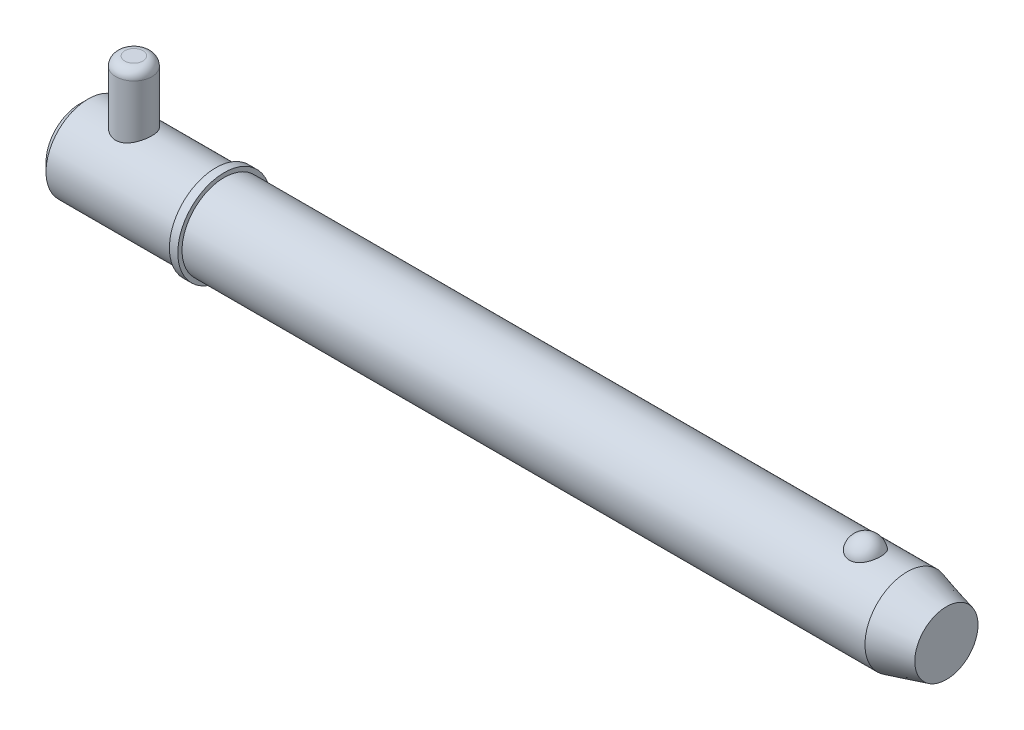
ISO-10303-21;
HEADER;
FILE_DESCRIPTION(('STEP AP214'),'2;1');
FILE_NAME('part.step','',(''),(''),'','','');
FILE_SCHEMA(('AUTOMOTIVE_DESIGN { 1 0 10303 214 1 1 1 1 }'));
ENDSEC;
DATA;
#1=APPLICATION_CONTEXT('core data for automotive mechanical design processes');
#2=APPLICATION_PROTOCOL_DEFINITION('international standard','automotive_design',2000,#1);
#3=PRODUCT_CONTEXT('',#1,'mechanical');
#4=PRODUCT('Part','Part','',(#3));
#5=PRODUCT_RELATED_PRODUCT_CATEGORY('part','',(#4));
#6=PRODUCT_DEFINITION_FORMATION('','',#4);
#7=PRODUCT_DEFINITION_CONTEXT('part definition',#1,'design');
#8=PRODUCT_DEFINITION('design','',#6,#7);
#9=PRODUCT_DEFINITION_SHAPE('','',#8);
#10=(LENGTH_UNIT() NAMED_UNIT(*) SI_UNIT(.MILLI.,.METRE.));
#11=(NAMED_UNIT(*) PLANE_ANGLE_UNIT() SI_UNIT($,.RADIAN.));
#12=(NAMED_UNIT(*) SI_UNIT($,.STERADIAN.) SOLID_ANGLE_UNIT());
#13=UNCERTAINTY_MEASURE_WITH_UNIT(LENGTH_MEASURE(1.E-05),#10,'distance_accuracy_value','');
#14=(GEOMETRIC_REPRESENTATION_CONTEXT(3) GLOBAL_UNCERTAINTY_ASSIGNED_CONTEXT((#13)) GLOBAL_UNIT_ASSIGNED_CONTEXT((#10,
#11,#12)) REPRESENTATION_CONTEXT('',''));
#15=CARTESIAN_POINT('',(0.,0.,0.));
#16=DIRECTION('',(0.,0.,1.));
#17=DIRECTION('',(1.,0.,0.));
#18=AXIS2_PLACEMENT_3D('',#15,#16,#17);
#19=CARTESIAN_POINT('',(14.28,26.985,0.));
#20=DIRECTION('',(0.,-1.,0.));
#21=DIRECTION('',(0.,0.,-1.));
#22=AXIS2_PLACEMENT_3D('',#19,#20,#21);
#23=CYLINDRICAL_SURFACE('',#22,4.76);
#24=CARTESIAN_POINT('',(14.28,-8.73500000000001,0.));
#25=DIRECTION('',(0.,1.,0.));
#26=DIRECTION('',(0.,0.,1.));
#27=AXIS2_PLACEMENT_3D('',#24,#25,#26);
#28=CIRCLE('',#27,4.76);
#29=CARTESIAN_POINT('',(14.28,-8.73500000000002,-4.76));
#30=VERTEX_POINT('',#29);
#31=EDGE_CURVE('P0_E25',#30,#30,#28,.T.);
#32=CARTESIAN_POINT('',(14.28,24.605,0.));
#33=DIRECTION('',(0.,1.,0.));
#34=DIRECTION('',(0.,0.,1.));
#35=AXIS2_PLACEMENT_3D('',#32,#33,#34);
#36=CIRCLE('',#35,4.76);
#37=CARTESIAN_POINT('',(14.28,24.605,-4.76));
#38=VERTEX_POINT('',#37);
#39=EDGE_CURVE('P0_E29',#38,#38,#36,.F.);
#40=CARTESIAN_POINT('',(14.28,-8.73500000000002,-4.76));
#41=CARTESIAN_POINT('',(14.28,-8.38770833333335,-4.76));
#42=CARTESIAN_POINT('',(14.28,-8.04041666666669,-4.76));
#43=CARTESIAN_POINT('',(14.28,-7.34583333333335,-4.76));
#44=CARTESIAN_POINT('',(14.28,-6.99854166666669,-4.76));
#45=CARTESIAN_POINT('',(14.28,-6.30395833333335,-4.76));
#46=CARTESIAN_POINT('',(14.28,-5.95666666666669,-4.76));
#47=CARTESIAN_POINT('',(14.28,-5.26208333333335,-4.76));
#48=CARTESIAN_POINT('',(14.28,-4.91479166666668,-4.76));
#49=CARTESIAN_POINT('',(14.28,-4.22020833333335,-4.76));
#50=CARTESIAN_POINT('',(14.28,-3.87291666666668,-4.76));
#51=CARTESIAN_POINT('',(14.28,-3.17833333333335,-4.76));
#52=CARTESIAN_POINT('',(14.28,-2.83104166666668,-4.76));
#53=CARTESIAN_POINT('',(14.28,-2.13645833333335,-4.76));
#54=CARTESIAN_POINT('',(14.28,-1.78916666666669,-4.76));
#55=CARTESIAN_POINT('',(14.28,-1.09458333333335,-4.76));
#56=CARTESIAN_POINT('',(14.28,-0.747291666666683,-4.76));
#57=CARTESIAN_POINT('',(14.28,-0.052708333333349,-4.76));
#58=CARTESIAN_POINT('',(14.28,0.294583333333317,-4.76));
#59=CARTESIAN_POINT('',(14.28,0.989166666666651,-4.76));
#60=CARTESIAN_POINT('',(14.28,1.33645833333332,-4.76));
#61=CARTESIAN_POINT('',(14.28,2.03104166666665,-4.76));
#62=CARTESIAN_POINT('',(14.28,2.37833333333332,-4.76));
#63=CARTESIAN_POINT('',(14.28,3.07291666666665,-4.76));
#64=CARTESIAN_POINT('',(14.28,3.42020833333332,-4.76));
#65=CARTESIAN_POINT('',(14.28,4.11479166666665,-4.76));
#66=CARTESIAN_POINT('',(14.28,4.46208333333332,-4.76));
#67=CARTESIAN_POINT('',(14.28,5.15666666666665,-4.76));
#68=CARTESIAN_POINT('',(14.28,5.50395833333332,-4.76));
#69=CARTESIAN_POINT('',(14.28,6.19854166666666,-4.76));
#70=CARTESIAN_POINT('',(14.28,6.54583333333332,-4.76));
#71=CARTESIAN_POINT('',(14.28,7.24041666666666,-4.76));
#72=CARTESIAN_POINT('',(14.28,7.58770833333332,-4.76));
#73=CARTESIAN_POINT('',(14.28,8.28229166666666,-4.76));
#74=CARTESIAN_POINT('',(14.28,8.62958333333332,-4.76));
#75=CARTESIAN_POINT('',(14.28,9.32416666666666,-4.76));
#76=CARTESIAN_POINT('',(14.28,9.67145833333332,-4.76));
#77=CARTESIAN_POINT('',(14.28,10.3660416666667,-4.76));
#78=CARTESIAN_POINT('',(14.28,10.7133333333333,-4.76));
#79=CARTESIAN_POINT('',(14.28,11.4079166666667,-4.76));
#80=CARTESIAN_POINT('',(14.28,11.7552083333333,-4.76));
#81=CARTESIAN_POINT('',(14.28,12.4497916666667,-4.76));
#82=CARTESIAN_POINT('',(14.28,12.7970833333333,-4.76));
#83=CARTESIAN_POINT('',(14.28,13.4916666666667,-4.76));
#84=CARTESIAN_POINT('',(14.28,13.8389583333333,-4.76));
#85=CARTESIAN_POINT('',(14.28,14.5335416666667,-4.76));
#86=CARTESIAN_POINT('',(14.28,14.8808333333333,-4.76));
#87=CARTESIAN_POINT('',(14.28,15.5754166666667,-4.76));
#88=CARTESIAN_POINT('',(14.28,15.9227083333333,-4.76));
#89=CARTESIAN_POINT('',(14.28,16.6172916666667,-4.76));
#90=CARTESIAN_POINT('',(14.28,16.9645833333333,-4.76));
#91=CARTESIAN_POINT('',(14.28,17.6591666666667,-4.76));
#92=CARTESIAN_POINT('',(14.28,18.0064583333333,-4.76));
#93=CARTESIAN_POINT('',(14.28,18.7010416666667,-4.76));
#94=CARTESIAN_POINT('',(14.28,19.0483333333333,-4.76));
#95=CARTESIAN_POINT('',(14.28,19.7429166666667,-4.76));
#96=CARTESIAN_POINT('',(14.28,20.0902083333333,-4.76));
#97=CARTESIAN_POINT('',(14.28,20.7847916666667,-4.76));
#98=CARTESIAN_POINT('',(14.28,21.1320833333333,-4.76));
#99=CARTESIAN_POINT('',(14.28,21.8266666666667,-4.76));
#100=CARTESIAN_POINT('',(14.28,22.1739583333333,-4.76));
#101=CARTESIAN_POINT('',(14.28,22.8685416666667,-4.76));
#102=CARTESIAN_POINT('',(14.28,23.2158333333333,-4.76));
#103=CARTESIAN_POINT('',(14.28,23.9104166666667,-4.76));
#104=CARTESIAN_POINT('',(14.28,24.2577083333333,-4.76));
#105=CARTESIAN_POINT('',(14.28,24.605,-4.76));
#106=B_SPLINE_CURVE_WITH_KNOTS('',3,(#40,#41,#42,#43,#44,#45,#46,#47,#48,#49,#50,#51,#52,#53,
#54,#55,#56,#57,#58,#59,#60,#61,#62,#63,#64,#65,#66,#67,#68,#69,#70,#71,#72,#73,#74,#75,#76,#77,
#78,#79,#80,#81,#82,#83,#84,#85,#86,#87,#88,#89,#90,#91,#92,#93,#94,#95,#96,#97,#98,#99,#100,
#101,#102,#103,#104,#105),.UNSPECIFIED.,.F.,.F.,(4,2,2,2,2,2,2,2,2,2,2,2,2,2,2,2,2,2,2,2,2,2,2,
2,2,2,2,2,2,2,2,2,4),(0.,1.041875,2.08375,3.125625,4.1675,5.209375,6.25125,7.293125,
8.33500000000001,9.376875,10.41875,11.460625,12.5025,13.544375,14.58625,15.628125,16.67,
17.711875,18.75375,19.795625,20.8375,21.879375,22.92125,23.963125,25.005,26.046875,27.08875,
28.130625,29.1725,30.214375,31.25625,32.298125,33.34),.UNSPECIFIED.);
#107=EDGE_CURVE('P0_BSEAM14',#30,#38,#106,.T.);
#108=ORIENTED_EDGE('',*,*,#31,.T.);
#109=ORIENTED_EDGE('',*,*,#39,.T.);
#110=ORIENTED_EDGE('',*,*,#107,.T.);
#111=ORIENTED_EDGE('',*,*,#107,.F.);
#112=EDGE_LOOP('',(#108,#110,#109,#111));
#113=FACE_BOUND('',#112,.T.);
#114=ADVANCED_FACE('P0_F14',(#113),#23,.T.);
#115=CARTESIAN_POINT('',(14.28,26.985,0.));
#116=DIRECTION('',(0.,1.,0.));
#117=DIRECTION('',(0.,0.,1.));
#118=AXIS2_PLACEMENT_3D('',#115,#116,#117);
#119=PLANE('',#118);
#120=CARTESIAN_POINT('',(14.28,26.985,0.));
#121=DIRECTION('',(0.,1.,0.));
#122=DIRECTION('',(0.,0.,1.));
#123=AXIS2_PLACEMENT_3D('',#120,#121,#122);
#124=CIRCLE('',#123,2.38);
#125=CARTESIAN_POINT('',(14.28,26.985,2.38));
#126=VERTEX_POINT('',#125);
#127=EDGE_CURVE('P0_E10',#126,#126,#124,.T.);
#128=ORIENTED_EDGE('',*,*,#127,.T.);
#129=EDGE_LOOP('',(#128));
#130=FACE_BOUND('',#129,.T.);
#131=ADVANCED_FACE('P0_F46',(#130),#119,.T.);
#132=CARTESIAN_POINT('',(14.28,-11.115,0.));
#133=DIRECTION('',(0.,1.,0.));
#134=DIRECTION('',(0.,0.,1.));
#135=AXIS2_PLACEMENT_3D('',#132,#133,#134);
#136=PLANE('',#135);
#137=CARTESIAN_POINT('',(14.28,-11.115,0.));
#138=DIRECTION('',(0.,1.,0.));
#139=DIRECTION('',(0.,0.,1.));
#140=AXIS2_PLACEMENT_3D('',#137,#138,#139);
#141=CIRCLE('',#140,2.38);
#142=CARTESIAN_POINT('',(14.28,-11.115,2.38));
#143=VERTEX_POINT('',#142);
#144=EDGE_CURVE('P0_E21',#143,#143,#141,.F.);
#145=ORIENTED_EDGE('',*,*,#144,.T.);
#146=EDGE_LOOP('',(#145));
#147=FACE_BOUND('',#146,.T.);
#148=ADVANCED_FACE('P0_F43',(#147),#136,.F.);
#149=CARTESIAN_POINT('',(14.28,-8.735,0.));
#150=DIRECTION('',(0.,1.,0.));
#151=DIRECTION('',(0.,0.,1.));
#152=AXIS2_PLACEMENT_3D('',#149,#150,#151);
#153=DEGENERATE_TOROIDAL_SURFACE('',#152,2.38,2.38,.T.);
#154=ORIENTED_EDGE('',*,*,#144,.F.);
#155=EDGE_LOOP('',(#154));
#156=FACE_BOUND('',#155,.T.);
#157=ORIENTED_EDGE('',*,*,#31,.F.);
#158=EDGE_LOOP('',(#157));
#159=FACE_BOUND('',#158,.T.);
#160=ADVANCED_FACE('P0_F38',(#156,#159),#153,.T.);
#161=CARTESIAN_POINT('',(14.28,24.605,0.));
#162=DIRECTION('',(0.,1.,0.));
#163=DIRECTION('',(0.,0.,1.));
#164=AXIS2_PLACEMENT_3D('',#161,#162,#163);
#165=DEGENERATE_TOROIDAL_SURFACE('',#164,2.38,2.38,.T.);
#166=ORIENTED_EDGE('',*,*,#39,.F.);
#167=EDGE_LOOP('',(#166));
#168=FACE_BOUND('',#167,.T.);
#169=ORIENTED_EDGE('',*,*,#127,.F.);
#170=EDGE_LOOP('',(#169));
#171=FACE_BOUND('',#170,.T.);
#172=ADVANCED_FACE('P0_F16',(#168,#171),#165,.T.);
#173=CLOSED_SHELL('',(#114,#131,#148,#160,#172));
#174=MANIFOLD_SOLID_BREP('P0_B1',#173);
#175=CARTESIAN_POINT('',(0.,0.,0.));
#176=DIRECTION('',(1.,0.,0.));
#177=DIRECTION('',(0.,0.,-1.));
#178=AXIS2_PLACEMENT_3D('',#175,#176,#177);
#179=CYLINDRICAL_SURFACE('',#178,11.115);
#180=CARTESIAN_POINT('',(218.229563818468,0.,0.));
#181=DIRECTION('',(1.,0.,0.));
#182=DIRECTION('',(0.,0.,-1.));
#183=AXIS2_PLACEMENT_3D('',#180,#181,#182);
#184=CIRCLE('',#183,11.115);
#185=CARTESIAN_POINT('',(218.229563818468,0.,-11.115));
#186=VERTEX_POINT('',#185);
#187=EDGE_CURVE('P1_E81',#186,#186,#184,.T.);
#188=ORIENTED_EDGE('',*,*,#187,.F.);
#189=EDGE_LOOP('',(#188));
#190=FACE_BOUND('',#189,.T.);
#191=CARTESIAN_POINT('',(38.1,0.,0.));
#192=DIRECTION('',(1.,0.,0.));
#193=DIRECTION('',(0.,0.,-1.));
#194=AXIS2_PLACEMENT_3D('',#191,#192,#193);
#195=CIRCLE('',#194,11.115);
#196=CARTESIAN_POINT('',(38.1,0.,-11.115));
#197=VERTEX_POINT('',#196);
#198=EDGE_CURVE('P1_E85',#197,#197,#195,.T.);
#199=ORIENTED_EDGE('',*,*,#198,.T.);
#200=EDGE_LOOP('',(#199));
#201=FACE_BOUND('',#200,.T.);
#202=CARTESIAN_POINT('',(207.231068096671,10.3028087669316,4.17077409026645));
#203=CARTESIAN_POINT('',(207.014775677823,10.3028003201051,4.17078240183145));
#204=CARTESIAN_POINT('',(206.798548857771,10.3098895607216,4.15340593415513));
#205=CARTESIAN_POINT('',(206.372540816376,10.3373834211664,4.08449540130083));
#206=CARTESIAN_POINT('',(206.162757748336,10.3577841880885,4.0329712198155));
#207=CARTESIAN_POINT('',(205.755782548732,10.4095237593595,3.89746513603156));
#208=CARTESIAN_POINT('',(205.558572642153,10.4408466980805,3.81353029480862));
#209=CARTESIAN_POINT('',(205.181338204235,10.5110236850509,3.61560339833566));
#210=CARTESIAN_POINT('',(205.001317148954,10.5498792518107,3.50160528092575));
#211=CARTESIAN_POINT('',(204.657684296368,10.6322884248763,3.24292464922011));
#212=CARTESIAN_POINT('',(204.494686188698,10.6759443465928,3.09746040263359));
#213=CARTESIAN_POINT('',(204.194591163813,10.7625291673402,2.7817192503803));
#214=CARTESIAN_POINT('',(204.057499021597,10.8054579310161,2.61143778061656));
#215=CARTESIAN_POINT('',(203.806408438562,10.8881935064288,2.24226695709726));
#216=CARTESIAN_POINT('',(203.693710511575,10.9277761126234,2.04244123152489));
#217=CARTESIAN_POINT('',(203.501777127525,10.997484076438,1.62578254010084));
#218=CARTESIAN_POINT('',(203.422544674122,11.0276085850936,1.40894804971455));
#219=CARTESIAN_POINT('',(203.298303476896,11.0756732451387,0.961250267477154));
#220=CARTESIAN_POINT('',(203.253760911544,11.0934470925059,0.730239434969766));
#221=CARTESIAN_POINT('',(203.201569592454,11.1143331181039,0.263439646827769));
#222=CARTESIAN_POINT('',(203.193920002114,11.1174456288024,0.027650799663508));
#223=CARTESIAN_POINT('',(203.21561056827,11.1087161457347,-0.440729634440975));
#224=CARTESIAN_POINT('',(203.244762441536,11.0969502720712,-0.673331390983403));
#225=CARTESIAN_POINT('',(203.339143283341,11.0597872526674,-1.12996621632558));
#226=CARTESIAN_POINT('',(203.404372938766,11.0343898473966,-1.35399912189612));
#227=CARTESIAN_POINT('',(203.56969844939,10.972515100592,-1.78750286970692));
#228=CARTESIAN_POINT('',(203.66983863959,10.9360236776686,-1.99695478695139));
#229=CARTESIAN_POINT('',(203.902940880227,10.8557595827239,-2.3952066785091));
#230=CARTESIAN_POINT('',(204.035905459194,10.8119863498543,-2.5840050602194));
#231=CARTESIAN_POINT('',(204.332407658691,10.7216733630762,-2.93635726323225));
#232=CARTESIAN_POINT('',(204.496056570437,10.675123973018,-3.09981510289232));
#233=CARTESIAN_POINT('',(204.849860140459,10.5846571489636,-3.39592247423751));
#234=CARTESIAN_POINT('',(205.040012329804,10.5407394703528,-3.52857487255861));
#235=CARTESIAN_POINT('',(205.43750141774,10.4616690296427,-3.75646057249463));
#236=CARTESIAN_POINT('',(205.64436705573,10.4263443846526,-3.85245432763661));
#237=CARTESIAN_POINT('',(206.072954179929,10.3675574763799,-4.00798747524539));
#238=CARTESIAN_POINT('',(206.294670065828,10.344090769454,-4.0675405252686));
#239=CARTESIAN_POINT('',(206.734669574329,10.3128282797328,-4.14614314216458));
#240=CARTESIAN_POINT('',(206.952565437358,10.3043040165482,-4.1670783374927));
#241=CARTESIAN_POINT('',(207.38894951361,10.3016771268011,-4.17357158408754));
#242=CARTESIAN_POINT('',(207.607437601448,10.3075716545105,-4.15913661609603));
#243=CARTESIAN_POINT('',(208.031744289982,10.3326686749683,-4.09636961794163));
#244=CARTESIAN_POINT('',(208.237745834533,10.3514555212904,-4.0490957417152));
#245=CARTESIAN_POINT('',(208.638576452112,10.399818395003,-3.92320197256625));
#246=CARTESIAN_POINT('',(208.8334046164,10.4293952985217,-3.84457953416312));
#247=CARTESIAN_POINT('',(209.211191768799,10.4969600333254,-3.65612410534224));
#248=CARTESIAN_POINT('',(209.393797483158,10.5351178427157,-3.54564545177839));
#249=CARTESIAN_POINT('',(209.738204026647,10.6154999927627,-3.29718036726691));
#250=CARTESIAN_POINT('',(209.900000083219,10.657725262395,-3.15918764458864));
#251=CARTESIAN_POINT('',(210.206959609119,10.744212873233,-2.85163580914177));
#252=CARTESIAN_POINT('',(210.350891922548,10.7884718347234,-2.68084605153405));
#253=CARTESIAN_POINT('',(210.609237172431,10.872374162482,-2.31721864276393));
#254=CARTESIAN_POINT('',(210.723644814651,10.9120167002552,-2.12437704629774));
#255=CARTESIAN_POINT('',(210.923873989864,10.9838919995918,-1.71516999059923));
#256=CARTESIAN_POINT('',(211.00866178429,11.0158465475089,-1.49824866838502));
#257=CARTESIAN_POINT('',(211.14268382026,11.0673523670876,-1.05228572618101));
#258=CARTESIAN_POINT('',(211.191917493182,11.086903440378,-0.823243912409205));
#259=CARTESIAN_POINT('',(211.253891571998,11.1116323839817,-0.359087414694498));
#260=CARTESIAN_POINT('',(211.266566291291,11.1167843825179,-0.123962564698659));
#261=CARTESIAN_POINT('',(211.254973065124,11.1121144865,0.345220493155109));
#262=CARTESIAN_POINT('',(211.230705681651,11.1022928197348,0.579278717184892));
#263=CARTESIAN_POINT('',(211.145907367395,11.0687504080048,1.03866534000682));
#264=CARTESIAN_POINT('',(211.085529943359,11.0450885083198,1.26402641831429));
#265=CARTESIAN_POINT('',(210.929853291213,10.9863185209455,1.70076772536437));
#266=CARTESIAN_POINT('',(210.834551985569,10.9512097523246,1.91214712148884));
#267=CARTESIAN_POINT('',(210.610397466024,10.8729733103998,2.316083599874));
#268=CARTESIAN_POINT('',(210.481380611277,10.8298068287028,2.50854240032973));
#269=CARTESIAN_POINT('',(210.192732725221,10.7401896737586,2.86808766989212));
#270=CARTESIAN_POINT('',(210.033102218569,10.6937390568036,3.03517457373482));
#271=CARTESIAN_POINT('',(209.687534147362,10.6029321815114,3.33857581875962));
#272=CARTESIAN_POINT('',(209.501708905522,10.5585680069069,3.47501541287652));
#273=CARTESIAN_POINT('',(209.107875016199,10.4769321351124,3.71390897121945));
#274=CARTESIAN_POINT('',(208.899863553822,10.439661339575,3.81635861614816));
#275=CARTESIAN_POINT('',(208.454066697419,10.3749407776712,3.98910631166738));
#276=CARTESIAN_POINT('',(208.215234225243,10.3482457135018,4.05700929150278));
#277=CARTESIAN_POINT('',(207.727925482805,10.312188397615,4.14782844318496));
#278=CARTESIAN_POINT('',(207.479453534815,10.3028184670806,4.17076454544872));
#279=CARTESIAN_POINT('',(207.231068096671,10.3028087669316,4.17077409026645));
#280=B_SPLINE_CURVE_WITH_KNOTS('',3,(#202,#203,#204,#205,#206,#207,#208,#209,#210,#211,#212,
#213,#214,#215,#216,#217,#218,#219,#220,#221,#222,#223,#224,#225,#226,#227,#228,#229,#230,#231,
#232,#233,#234,#235,#236,#237,#238,#239,#240,#241,#242,#243,#244,#245,#246,#247,#248,#249,#250,
#251,#252,#253,#254,#255,#256,#257,#258,#259,#260,#261,#262,#263,#264,#265,#266,#267,#268,#269,
#270,#271,#272,#273,#274,#275,#276,#277,#278,#279),.UNSPECIFIED.,.T.,.F.,(4,2,2,2,2,2,2,2,2,2,2,
2,2,2,2,2,2,2,2,2,2,2,2,2,2,2,2,2,2,2,2,2,2,2,2,2,2,2,4),(0.,0.64796614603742,1.29574482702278,
1.9425864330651,2.58955857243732,3.25496465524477,3.92049326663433,4.61566368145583,
5.31089647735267,6.01531821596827,6.71972398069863,7.42054043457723,8.12137023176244,
8.82309331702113,9.5248704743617,10.2292439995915,10.9335519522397,11.6223330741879,
12.3108558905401,12.9647664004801,13.6185478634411,14.252184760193,14.8858731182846,
15.5334360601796,16.1811472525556,16.8611459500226,17.5412664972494,18.2431855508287,
18.9451158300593,19.6483065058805,20.3514864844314,21.0516982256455,21.7519516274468,
22.4556690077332,23.1593743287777,23.860149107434,24.5610129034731,25.3054529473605,
26.049562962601),.UNSPECIFIED.);
#281=CARTESIAN_POINT('',(207.231068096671,10.3028087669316,4.17077409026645));
#282=VERTEX_POINT('',#281);
#283=EDGE_CURVE('P1_E35',#282,#282,#280,.T.);
#284=ORIENTED_EDGE('',*,*,#283,.T.);
#285=EDGE_LOOP('',(#284));
#286=FACE_BOUND('',#285,.T.);
#287=ADVANCED_FACE('P1_F13',(#190,#201,#286),#179,.T.);
#288=CARTESIAN_POINT('',(0.,0.,0.));
#289=DIRECTION('',(-1.,0.,0.));
#290=DIRECTION('',(0.,0.,1.));
#291=AXIS2_PLACEMENT_3D('',#288,#289,#290);
#292=PLANE('',#291);
#293=CARTESIAN_POINT('',(0.,0.,0.));
#294=DIRECTION('',(1.,0.,0.));
#295=DIRECTION('',(0.,0.,-1.));
#296=AXIS2_PLACEMENT_3D('',#293,#294,#295);
#297=CIRCLE('',#296,8.892);
#298=CARTESIAN_POINT('',(0.,0.,-8.892));
#299=VERTEX_POINT('',#298);
#300=EDGE_CURVE('P1_E9',#299,#299,#297,.T.);
#301=ORIENTED_EDGE('',*,*,#300,.F.);
#302=EDGE_LOOP('',(#301));
#303=FACE_BOUND('',#302,.T.);
#304=ADVANCED_FACE('P1_F15',(#303),#292,.T.);
#305=CARTESIAN_POINT('',(2.22299999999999,0.,0.));
#306=DIRECTION('',(1.,0.,0.));
#307=DIRECTION('',(0.,0.,-1.));
#308=AXIS2_PLACEMENT_3D('',#305,#306,#307);
#309=CONICAL_SURFACE('',#308,11.115,0.78539816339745);
#310=ORIENTED_EDGE('',*,*,#300,.T.);
#311=EDGE_LOOP('',(#310));
#312=FACE_BOUND('',#311,.T.);
#313=CARTESIAN_POINT('',(2.22299999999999,0.,0.));
#314=DIRECTION('',(1.,0.,0.));
#315=DIRECTION('',(0.,0.,-1.));
#316=AXIS2_PLACEMENT_3D('',#313,#314,#315);
#317=CIRCLE('',#316,11.115);
#318=CARTESIAN_POINT('',(2.22299999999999,0.,-11.115));
#319=VERTEX_POINT('',#318);
#320=EDGE_CURVE('P1_E26',#319,#319,#317,.T.);
#321=ORIENTED_EDGE('',*,*,#320,.F.);
#322=EDGE_LOOP('',(#321));
#323=FACE_BOUND('',#322,.T.);
#324=ADVANCED_FACE('P1_F77',(#312,#323),#309,.T.);
#325=CARTESIAN_POINT('',(0.,0.,0.));
#326=DIRECTION('',(1.,0.,0.));
#327=DIRECTION('',(0.,0.,-1.));
#328=AXIS2_PLACEMENT_3D('',#325,#326,#327);
#329=CYLINDRICAL_SURFACE('',#328,11.115);
#330=CARTESIAN_POINT('',(14.28,-10.0441836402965,4.76));
#331=CARTESIAN_POINT('',(14.1533731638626,-10.0441846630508,4.75999904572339));
#332=CARTESIAN_POINT('',(14.0267055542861,-10.0465865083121,4.75493985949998));
#333=CARTESIAN_POINT('',(13.774298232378,-10.0561141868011,4.73475585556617));
#334=CARTESIAN_POINT('',(13.6485591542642,-10.0632429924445,4.71962470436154));
#335=CARTESIAN_POINT('',(13.3987500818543,-10.0819979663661,4.67942666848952));
#336=CARTESIAN_POINT('',(13.2746840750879,-10.0936334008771,4.65433930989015));
#337=CARTESIAN_POINT('',(13.0293244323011,-10.1210146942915,4.59449317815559));
#338=CARTESIAN_POINT('',(12.9080319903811,-10.1367622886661,4.55973032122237));
#339=CARTESIAN_POINT('',(12.669614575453,-10.1717810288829,4.48106435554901));
#340=CARTESIAN_POINT('',(12.5524727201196,-10.1910352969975,4.4372048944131));
#341=CARTESIAN_POINT('',(12.3224300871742,-10.2325403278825,4.34063417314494));
#342=CARTESIAN_POINT('',(12.2095309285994,-10.2547922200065,4.28791957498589));
#343=CARTESIAN_POINT('',(11.8782785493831,-10.3250879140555,4.11715127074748));
#344=CARTESIAN_POINT('',(11.6670799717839,-10.3767168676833,3.98637638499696));
#345=CARTESIAN_POINT('',(11.2564039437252,-10.4874309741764,3.68567149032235));
#346=CARTESIAN_POINT('',(11.0583793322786,-10.5467772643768,3.51386978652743));
#347=CARTESIAN_POINT('',(10.6927724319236,-10.6641377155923,3.13969960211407));
#348=CARTESIAN_POINT('',(10.5252022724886,-10.7221513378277,2.93731900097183));
#349=CARTESIAN_POINT('',(10.2965609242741,-10.8050020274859,2.60935726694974));
#350=CARTESIAN_POINT('',(10.2227768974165,-10.8324811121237,2.49310321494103));
#351=CARTESIAN_POINT('',(10.0853380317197,-10.884703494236,2.25418999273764));
#352=CARTESIAN_POINT('',(10.0216789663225,-10.9094479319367,2.13153352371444));
#353=CARTESIAN_POINT('',(9.90506238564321,-10.9554932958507,1.88060370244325));
#354=CARTESIAN_POINT('',(9.85210574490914,-10.9767939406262,1.7523298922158));
#355=CARTESIAN_POINT('',(9.75746464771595,-11.0153112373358,1.49115740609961));
#356=CARTESIAN_POINT('',(9.71577447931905,-11.0325299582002,1.35826111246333));
#357=CARTESIAN_POINT('',(9.64605475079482,-11.0615607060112,1.09614539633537));
#358=CARTESIAN_POINT('',(9.61740732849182,-11.0736151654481,0.96711700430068));
#359=CARTESIAN_POINT('',(9.57092026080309,-11.0932687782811,0.706847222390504));
#360=CARTESIAN_POINT('',(9.55307574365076,-11.1008699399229,0.575606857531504));
#361=CARTESIAN_POINT('',(9.52838640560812,-11.1114054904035,0.31192917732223));
#362=CARTESIAN_POINT('',(9.52153986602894,-11.114340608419,0.179492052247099));
#363=CARTESIAN_POINT('',(9.51892405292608,-11.1154607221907,-0.0855090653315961));
#364=CARTESIAN_POINT('',(9.52315432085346,-11.1136459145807,-0.218073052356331));
#365=CARTESIAN_POINT('',(9.542009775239,-11.1055891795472,-0.473709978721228));
#366=CARTESIAN_POINT('',(9.55594693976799,-11.099640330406,-0.596843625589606));
#367=CARTESIAN_POINT('',(9.59332832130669,-11.0837823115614,-0.841440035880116));
#368=CARTESIAN_POINT('',(9.61677567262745,-11.0738718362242,-0.962902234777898));
#369=CARTESIAN_POINT('',(9.67294089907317,-11.0503378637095,-1.20325684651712));
#370=CARTESIAN_POINT('',(9.70565569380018,-11.0367156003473,-1.32215009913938));
#371=CARTESIAN_POINT('',(9.78005008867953,-11.0060908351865,-1.55666640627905));
#372=CARTESIAN_POINT('',(9.82173311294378,-10.9890870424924,-1.67228819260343));
#373=CARTESIAN_POINT('',(9.96110379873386,-10.9330280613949,-2.01656166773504));
#374=CARTESIAN_POINT('',(10.0722987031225,-10.8892801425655,-2.23915547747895));
#375=CARTESIAN_POINT('',(10.3268588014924,-10.7934745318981,-2.66299199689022));
#376=CARTESIAN_POINT('',(10.4702355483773,-10.7414138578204,-2.86422700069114));
#377=CARTESIAN_POINT('',(10.7973904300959,-10.6296201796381,-3.25557775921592));
#378=CARTESIAN_POINT('',(10.9833705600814,-10.569604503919,-3.443774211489));
#379=CARTESIAN_POINT('',(11.3844486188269,-10.4514707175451,-3.78722133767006));
#380=CARTESIAN_POINT('',(11.5995590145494,-10.3933534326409,-3.94245783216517));
#381=CARTESIAN_POINT('',(11.9444340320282,-10.311516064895,-4.14990014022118));
#382=CARTESIAN_POINT('',(12.0654579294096,-10.2847012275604,-4.21573894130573));
#383=CARTESIAN_POINT('',(12.3132718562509,-10.2342051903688,-4.33688518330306));
#384=CARTESIAN_POINT('',(12.4400593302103,-10.2105226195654,-4.39219723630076));
#385=CARTESIAN_POINT('',(12.6985418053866,-10.1671237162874,-4.49174500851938));
#386=CARTESIAN_POINT('',(12.8302359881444,-10.1474067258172,-4.53598256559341));
#387=CARTESIAN_POINT('',(13.0975061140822,-10.1126841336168,-4.61287629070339));
#388=CARTESIAN_POINT('',(13.233079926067,-10.0976759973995,-4.64553869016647));
#389=CARTESIAN_POINT('',(13.4978553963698,-10.0737863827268,-4.6971059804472));
#390=CARTESIAN_POINT('',(13.6268754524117,-10.0645618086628,-4.716785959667));
#391=CARTESIAN_POINT('',(13.8862990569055,-10.051062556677,-4.74548419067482));
#392=CARTESIAN_POINT('',(14.0167019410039,-10.0467856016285,-4.75450734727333));
#393=CARTESIAN_POINT('',(14.277859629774,-10.0433352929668,-4.76179143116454));
#394=CARTESIAN_POINT('',(14.4086143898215,-10.0441613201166,-4.76005366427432));
#395=CARTESIAN_POINT('',(14.6694025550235,-10.0508838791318,-4.74584231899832));
#396=CARTESIAN_POINT('',(14.7994359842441,-10.0567802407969,-4.73336910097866));
#397=CARTESIAN_POINT('',(15.0487369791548,-10.0728449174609,-4.69907984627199));
#398=CARTESIAN_POINT('',(15.1681238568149,-10.0826872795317,-4.67797462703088));
#399=CARTESIAN_POINT('',(15.4045894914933,-10.1062580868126,-4.62682977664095));
#400=CARTESIAN_POINT('',(15.5216674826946,-10.1199877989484,-4.59678723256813));
#401=CARTESIAN_POINT('',(15.868278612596,-10.1664161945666,-4.49365911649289));
#402=CARTESIAN_POINT('',(16.0933756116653,-10.2043671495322,-4.40754694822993));
#403=CARTESIAN_POINT('',(16.5357981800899,-10.2919879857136,-4.19898201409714));
#404=CARTESIAN_POINT('',(16.7523611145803,-10.3420954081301,-4.07511281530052));
#405=CARTESIAN_POINT('',(17.1627188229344,-10.4477911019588,-3.7959429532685));
#406=CARTESIAN_POINT('',(17.3565033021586,-10.5033818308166,-3.64062816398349));
#407=CARTESIAN_POINT('',(17.7334034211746,-10.6196376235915,-3.28693729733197));
#408=CARTESIAN_POINT('',(17.9141276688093,-10.6803237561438,-3.08599175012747));
#409=CARTESIAN_POINT('',(18.1582189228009,-10.7666348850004,-2.76320365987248));
#410=CARTESIAN_POINT('',(18.2351223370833,-10.7946346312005,-2.65197124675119));
#411=CARTESIAN_POINT('',(18.3793967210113,-10.8483267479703,-2.42297927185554));
#412=CARTESIAN_POINT('',(18.4467718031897,-10.87402011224,-2.30522255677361));
#413=CARTESIAN_POINT('',(18.5717669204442,-10.9225249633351,-2.06324665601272));
#414=CARTESIAN_POINT('',(18.6293326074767,-10.9453202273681,-1.93899615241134));
#415=CARTESIAN_POINT('',(18.73370006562,-10.9872100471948,-1.6855059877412));
#416=CARTESIAN_POINT('',(18.7805065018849,-11.0063062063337,-1.55626851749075));
#417=CARTESIAN_POINT('',(18.8628731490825,-11.0402419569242,-1.29375150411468));
#418=CARTESIAN_POINT('',(18.8984366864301,-11.0550828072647,-1.16047316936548));
#419=CARTESIAN_POINT('',(18.9579183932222,-11.0800638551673,-0.890912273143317));
#420=CARTESIAN_POINT('',(18.9818374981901,-11.0902044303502,-0.75462995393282));
#421=CARTESIAN_POINT('',(19.0164177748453,-11.104911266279,-0.490295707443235));
#422=CARTESIAN_POINT('',(19.027922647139,-11.1098318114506,-0.362373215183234));
#423=CARTESIAN_POINT('',(19.040554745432,-11.1152360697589,-0.105876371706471));
#424=CARTESIAN_POINT('',(19.0416784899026,-11.1157182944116,0.0226981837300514));
#425=CARTESIAN_POINT('',(19.0335275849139,-11.1122291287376,0.27938352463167));
#426=CARTESIAN_POINT('',(19.0242587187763,-11.1082602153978,0.407494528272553));
#427=CARTESIAN_POINT('',(18.9954320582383,-11.0959792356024,0.662388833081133));
#428=CARTESIAN_POINT('',(18.9758704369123,-11.0876655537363,0.789171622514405));
#429=CARTESIAN_POINT('',(18.9276379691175,-11.0673259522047,1.03545890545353));
#430=CARTESIAN_POINT('',(18.8993573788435,-11.0554596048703,1.15505309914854));
#431=CARTESIAN_POINT('',(18.8337694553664,-11.0282166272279,1.39134516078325));
#432=CARTESIAN_POINT('',(18.7964589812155,-11.0128387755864,1.5080420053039));
#433=CARTESIAN_POINT('',(18.671464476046,-10.9619666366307,1.85262797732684));
#434=CARTESIAN_POINT('',(18.5706772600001,-10.9217161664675,2.07521484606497));
#435=CARTESIAN_POINT('',(18.33202463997,-10.8301378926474,2.51061719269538));
#436=CARTESIAN_POINT('',(18.1926775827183,-10.7783885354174,2.72252375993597));
#437=CARTESIAN_POINT('',(17.8829747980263,-10.669863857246,3.12088015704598));
#438=CARTESIAN_POINT('',(17.7126068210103,-10.6130865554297,3.30731987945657));
#439=CARTESIAN_POINT('',(17.3310036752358,-10.495668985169,3.66358491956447));
#440=CARTESIAN_POINT('',(17.1177010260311,-10.4350471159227,3.83122543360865));
#441=CARTESIAN_POINT('',(16.7778915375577,-10.3495418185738,4.05420569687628));
#442=CARTESIAN_POINT('',(16.6612023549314,-10.3219229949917,4.12383380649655));
#443=CARTESIAN_POINT('',(16.4218466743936,-10.2693487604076,4.25306463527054));
#444=CARTESIAN_POINT('',(16.2991829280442,-10.2443921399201,4.31267191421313));
#445=CARTESIAN_POINT('',(16.0488008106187,-10.1979981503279,4.42126071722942));
#446=CARTESIAN_POINT('',(15.9210894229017,-10.1765561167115,4.47025635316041));
#447=CARTESIAN_POINT('',(15.6613937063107,-10.1379191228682,4.55720152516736));
#448=CARTESIAN_POINT('',(15.5294115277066,-10.1207220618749,4.59515652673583));
#449=CARTESIAN_POINT('',(15.2624981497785,-10.091252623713,4.65951684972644));
#450=CARTESIAN_POINT('',(15.1275757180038,-10.0789672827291,4.68595259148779));
#451=CARTESIAN_POINT('',(14.8556442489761,-10.0597530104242,4.72706206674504));
#452=CARTESIAN_POINT('',(14.7186368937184,-10.0528199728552,4.74174481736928));
#453=CARTESIAN_POINT('',(14.5310955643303,-10.047196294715,4.75363843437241));
#454=CARTESIAN_POINT('',(14.48091543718,-10.0460674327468,4.75602323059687));
#455=CARTESIAN_POINT('',(14.3804923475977,-10.044560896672,4.7592042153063));
#456=CARTESIAN_POINT('',(14.3302493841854,-10.0441832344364,4.76000037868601));
#457=CARTESIAN_POINT('',(14.28,-10.0441836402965,4.76));
#458=B_SPLINE_CURVE_WITH_KNOTS('',3,(#330,#331,#332,#333,#334,#335,#336,#337,#338,#339,#340,
#341,#342,#343,#344,#345,#346,#347,#348,#349,#350,#351,#352,#353,#354,#355,#356,#357,#358,#359,
#360,#361,#362,#363,#364,#365,#366,#367,#368,#369,#370,#371,#372,#373,#374,#375,#376,#377,#378,
#379,#380,#381,#382,#383,#384,#385,#386,#387,#388,#389,#390,#391,#392,#393,#394,#395,#396,#397,
#398,#399,#400,#401,#402,#403,#404,#405,#406,#407,#408,#409,#410,#411,#412,#413,#414,#415,#416,
#417,#418,#419,#420,#421,#422,#423,#424,#425,#426,#427,#428,#429,#430,#431,#432,#433,#434,#435,
#436,#437,#438,#439,#440,#441,#442,#443,#444,#445,#446,#447,#448,#449,#450,#451,#452,#453,#454,
#455,#456,#457),.UNSPECIFIED.,.T.,.F.,(4,2,2,2,2,2,2,2,2,2,2,2,2,2,2,2,2,2,2,2,2,2,2,2,2,2,2,2,
2,2,2,2,2,2,2,2,2,2,2,2,2,2,2,2,2,2,2,2,2,2,2,2,2,2,2,2,2,2,2,2,2,2,2,4),(0.,0.379828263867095,
0.759895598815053,1.14074858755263,1.52176256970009,1.90098898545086,2.28035867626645,
3.03818035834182,3.84125131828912,4.6446414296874,5.06541657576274,5.48601561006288,
5.90664899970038,6.3270687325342,6.72470503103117,7.12216187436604,7.51955659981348,
7.91693487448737,8.28868404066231,8.66055582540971,9.03230414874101,9.40419465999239,
10.1585834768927,10.9132435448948,11.7236471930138,12.5343987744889,12.9550196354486,
13.3754557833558,13.7958221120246,14.2159617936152,14.6079540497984,14.9997658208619,
15.3915300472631,15.7832811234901,16.1477615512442,16.512360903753,17.240999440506,
18.0012974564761,18.761937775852,19.5886929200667,20.0025782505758,20.4162843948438,
20.832212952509,21.2479608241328,21.6635855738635,22.0791769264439,22.4642880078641,
22.8495282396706,23.2345541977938,23.6197234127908,23.9896813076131,24.3597680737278,
25.099327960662,25.8726239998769,26.6462260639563,27.4759193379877,27.8914891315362,
28.3068693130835,28.7216936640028,29.1363123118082,29.5498292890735,29.9630287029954,
30.113753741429,30.2644811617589),.UNSPECIFIED.);
#459=CARTESIAN_POINT('',(14.28,-10.0441836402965,4.76));
#460=VERTEX_POINT('',#459);
#461=EDGE_CURVE('P1_E17',#460,#460,#458,.T.);
#462=ORIENTED_EDGE('',*,*,#461,.F.);
#463=EDGE_LOOP('',(#462));
#464=FACE_BOUND('',#463,.T.);
#465=CARTESIAN_POINT('',(14.28,10.0441836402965,4.76));
#466=CARTESIAN_POINT('',(14.4066268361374,10.0441846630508,4.75999904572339));
#467=CARTESIAN_POINT('',(14.5332944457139,10.0465865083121,4.75493985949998));
#468=CARTESIAN_POINT('',(14.785701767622,10.0561141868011,4.73475585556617));
#469=CARTESIAN_POINT('',(14.9114408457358,10.0632429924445,4.71962470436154));
#470=CARTESIAN_POINT('',(15.1612499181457,10.0819979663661,4.67942666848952));
#471=CARTESIAN_POINT('',(15.2853159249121,10.0936334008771,4.65433930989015));
#472=CARTESIAN_POINT('',(15.5306755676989,10.1210146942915,4.59449317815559));
#473=CARTESIAN_POINT('',(15.6519680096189,10.1367622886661,4.55973032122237));
#474=CARTESIAN_POINT('',(15.890385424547,10.1717810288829,4.48106435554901));
#475=CARTESIAN_POINT('',(16.0075272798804,10.1910352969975,4.4372048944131));
#476=CARTESIAN_POINT('',(16.2375699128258,10.2325403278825,4.34063417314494));
#477=CARTESIAN_POINT('',(16.3504690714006,10.2547922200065,4.28791957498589));
#478=CARTESIAN_POINT('',(16.6817214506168,10.3250879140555,4.11715127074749));
#479=CARTESIAN_POINT('',(16.8929200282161,10.3767168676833,3.98637638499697));
#480=CARTESIAN_POINT('',(17.3035960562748,10.4874309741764,3.68567149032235));
#481=CARTESIAN_POINT('',(17.5016206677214,10.5467772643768,3.51386978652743));
#482=CARTESIAN_POINT('',(17.8672275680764,10.6641377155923,3.13969960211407));
#483=CARTESIAN_POINT('',(18.0347977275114,10.7221513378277,2.93731900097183));
#484=CARTESIAN_POINT('',(18.2634390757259,10.8050020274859,2.60935726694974));
#485=CARTESIAN_POINT('',(18.3372231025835,10.8324811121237,2.49310321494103));
#486=CARTESIAN_POINT('',(18.4746619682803,10.884703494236,2.25418999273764));
#487=CARTESIAN_POINT('',(18.5383210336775,10.9094479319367,2.13153352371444));
#488=CARTESIAN_POINT('',(18.6549376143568,10.9554932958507,1.88060370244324));
#489=CARTESIAN_POINT('',(18.7078942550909,10.9767939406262,1.75232989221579));
#490=CARTESIAN_POINT('',(18.8025353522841,11.0153112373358,1.4911574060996));
#491=CARTESIAN_POINT('',(18.844225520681,11.0325299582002,1.35826111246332));
#492=CARTESIAN_POINT('',(18.9139452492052,11.0615607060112,1.09614539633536));
#493=CARTESIAN_POINT('',(18.9425926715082,11.0736151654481,0.967117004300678));
#494=CARTESIAN_POINT('',(18.9890797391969,11.0932687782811,0.706847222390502));
#495=CARTESIAN_POINT('',(19.0069242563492,11.1008699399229,0.575606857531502));
#496=CARTESIAN_POINT('',(19.0316135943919,11.1114054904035,0.311929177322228));
#497=CARTESIAN_POINT('',(19.0384601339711,11.114340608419,0.179492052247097));
#498=CARTESIAN_POINT('',(19.0410759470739,11.1154607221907,-0.0855090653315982));
#499=CARTESIAN_POINT('',(19.0368456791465,11.1136459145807,-0.218073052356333));
#500=CARTESIAN_POINT('',(19.017990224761,11.1055891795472,-0.47370997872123));
#501=CARTESIAN_POINT('',(19.004053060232,11.099640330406,-0.596843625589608));
#502=CARTESIAN_POINT('',(18.9666716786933,11.0837823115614,-0.841440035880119));
#503=CARTESIAN_POINT('',(18.9432243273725,11.0738718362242,-0.9629022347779));
#504=CARTESIAN_POINT('',(18.8870591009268,11.0503378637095,-1.20325684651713));
#505=CARTESIAN_POINT('',(18.8543443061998,11.0367156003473,-1.32215009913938));
#506=CARTESIAN_POINT('',(18.7799499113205,11.0060908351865,-1.55666640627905));
#507=CARTESIAN_POINT('',(18.7382668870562,10.9890870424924,-1.67228819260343));
#508=CARTESIAN_POINT('',(18.5988962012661,10.9330280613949,-2.01656166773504));
#509=CARTESIAN_POINT('',(18.4877012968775,10.8892801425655,-2.23915547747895));
#510=CARTESIAN_POINT('',(18.2331411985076,10.7934745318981,-2.66299199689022));
#511=CARTESIAN_POINT('',(18.0897644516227,10.7414138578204,-2.86422700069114));
#512=CARTESIAN_POINT('',(17.7626095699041,10.6296201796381,-3.25557775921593));
#513=CARTESIAN_POINT('',(17.5766294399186,10.569604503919,-3.443774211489));
#514=CARTESIAN_POINT('',(17.1755513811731,10.4514707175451,-3.78722133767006));
#515=CARTESIAN_POINT('',(16.9604409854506,10.3933534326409,-3.94245783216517));
#516=CARTESIAN_POINT('',(16.6155659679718,10.311516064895,-4.14990014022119));
#517=CARTESIAN_POINT('',(16.4945420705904,10.2847012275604,-4.21573894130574));
#518=CARTESIAN_POINT('',(16.2467281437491,10.2342051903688,-4.33688518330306));
#519=CARTESIAN_POINT('',(16.1199406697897,10.2105226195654,-4.39219723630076));
#520=CARTESIAN_POINT('',(15.8614581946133,10.1671237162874,-4.49174500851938));
#521=CARTESIAN_POINT('',(15.7297640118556,10.1474067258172,-4.53598256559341));
#522=CARTESIAN_POINT('',(15.4624938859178,10.1126841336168,-4.61287629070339));
#523=CARTESIAN_POINT('',(15.326920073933,10.0976759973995,-4.64553869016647));
#524=CARTESIAN_POINT('',(15.0621446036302,10.0737863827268,-4.6971059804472));
#525=CARTESIAN_POINT('',(14.9331245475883,10.0645618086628,-4.716785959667));
#526=CARTESIAN_POINT('',(14.6737009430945,10.051062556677,-4.74548419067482));
#527=CARTESIAN_POINT('',(14.543298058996,10.0467856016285,-4.75450734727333));
#528=CARTESIAN_POINT('',(14.2821403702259,10.0433352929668,-4.76179143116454));
#529=CARTESIAN_POINT('',(14.1513856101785,10.0441613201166,-4.76005366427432));
#530=CARTESIAN_POINT('',(13.8905974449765,10.0508838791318,-4.74584231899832));
#531=CARTESIAN_POINT('',(13.7605640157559,10.0567802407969,-4.73336910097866));
#532=CARTESIAN_POINT('',(13.5112630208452,10.0728449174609,-4.69907984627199));
#533=CARTESIAN_POINT('',(13.3918761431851,10.0826872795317,-4.67797462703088));
#534=CARTESIAN_POINT('',(13.1554105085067,10.1062580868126,-4.62682977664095));
#535=CARTESIAN_POINT('',(13.0383325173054,10.1199877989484,-4.59678723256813));
#536=CARTESIAN_POINT('',(12.691721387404,10.1664161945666,-4.49365911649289));
#537=CARTESIAN_POINT('',(12.4666243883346,10.2043671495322,-4.40754694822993));
#538=CARTESIAN_POINT('',(12.0242018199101,10.2919879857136,-4.19898201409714));
#539=CARTESIAN_POINT('',(11.8076388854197,10.3420954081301,-4.07511281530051));
#540=CARTESIAN_POINT('',(11.3972811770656,10.4477911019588,-3.7959429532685));
#541=CARTESIAN_POINT('',(11.2034966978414,10.5033818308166,-3.64062816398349));
#542=CARTESIAN_POINT('',(10.8265965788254,10.6196376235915,-3.28693729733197));
#543=CARTESIAN_POINT('',(10.6458723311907,10.6803237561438,-3.08599175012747));
#544=CARTESIAN_POINT('',(10.4017810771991,10.7666348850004,-2.76320365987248));
#545=CARTESIAN_POINT('',(10.3248776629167,10.7946346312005,-2.65197124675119));
#546=CARTESIAN_POINT('',(10.1806032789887,10.8483267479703,-2.42297927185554));
#547=CARTESIAN_POINT('',(10.1132281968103,10.87402011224,-2.30522255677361));
#548=CARTESIAN_POINT('',(9.98823307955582,10.9225249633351,-2.06324665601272));
#549=CARTESIAN_POINT('',(9.93066739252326,10.9453202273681,-1.93899615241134));
#550=CARTESIAN_POINT('',(9.82629993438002,10.9872100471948,-1.6855059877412));
#551=CARTESIAN_POINT('',(9.77949349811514,11.0063062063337,-1.55626851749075));
#552=CARTESIAN_POINT('',(9.69712685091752,11.0402419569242,-1.29375150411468));
#553=CARTESIAN_POINT('',(9.66156331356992,11.0550828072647,-1.16047316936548));
#554=CARTESIAN_POINT('',(9.60208160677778,11.0800638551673,-0.890912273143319));
#555=CARTESIAN_POINT('',(9.57816250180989,11.0902044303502,-0.754629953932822));
#556=CARTESIAN_POINT('',(9.54358222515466,11.104911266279,-0.490295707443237));
#557=CARTESIAN_POINT('',(9.53207735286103,11.1098318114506,-0.362373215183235));
#558=CARTESIAN_POINT('',(9.51944525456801,11.1152360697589,-0.105876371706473));
#559=CARTESIAN_POINT('',(9.51832151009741,11.1157182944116,0.0226981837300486));
#560=CARTESIAN_POINT('',(9.52647241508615,11.1122291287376,0.279383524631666));
#561=CARTESIAN_POINT('',(9.53574128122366,11.1082602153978,0.407494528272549));
#562=CARTESIAN_POINT('',(9.5645679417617,11.0959792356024,0.662388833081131));
#563=CARTESIAN_POINT('',(9.58412956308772,11.0876655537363,0.789171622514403));
#564=CARTESIAN_POINT('',(9.63236203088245,11.0673259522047,1.03545890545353));
#565=CARTESIAN_POINT('',(9.66064262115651,11.0554596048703,1.15505309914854));
#566=CARTESIAN_POINT('',(9.72623054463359,11.0282166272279,1.39134516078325));
#567=CARTESIAN_POINT('',(9.76354101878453,11.0128387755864,1.5080420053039));
#568=CARTESIAN_POINT('',(9.88853552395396,10.9619666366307,1.85262797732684));
#569=CARTESIAN_POINT('',(9.98932273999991,10.9217161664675,2.07521484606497));
#570=CARTESIAN_POINT('',(10.22797536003,10.8301378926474,2.51061719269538));
#571=CARTESIAN_POINT('',(10.3673224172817,10.7783885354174,2.72252375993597));
#572=CARTESIAN_POINT('',(10.6770252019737,10.669863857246,3.12088015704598));
#573=CARTESIAN_POINT('',(10.8473931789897,10.6130865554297,3.30731987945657));
#574=CARTESIAN_POINT('',(11.2289963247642,10.495668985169,3.66358491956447));
#575=CARTESIAN_POINT('',(11.4422989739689,10.4350471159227,3.83122543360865));
#576=CARTESIAN_POINT('',(11.7821084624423,10.3495418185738,4.05420569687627));
#577=CARTESIAN_POINT('',(11.8987976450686,10.3219229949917,4.12383380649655));
#578=CARTESIAN_POINT('',(12.1381533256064,10.2693487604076,4.25306463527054));
#579=CARTESIAN_POINT('',(12.2608170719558,10.2443921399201,4.31267191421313));
#580=CARTESIAN_POINT('',(12.5111991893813,10.1979981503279,4.42126071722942));
#581=CARTESIAN_POINT('',(12.6389105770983,10.1765561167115,4.47025635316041));
#582=CARTESIAN_POINT('',(12.8986062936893,10.1379191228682,4.55720152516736));
#583=CARTESIAN_POINT('',(13.0305884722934,10.1207220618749,4.59515652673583));
#584=CARTESIAN_POINT('',(13.2975018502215,10.091252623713,4.65951684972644));
#585=CARTESIAN_POINT('',(13.4324242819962,10.0789672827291,4.68595259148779));
#586=CARTESIAN_POINT('',(13.7043557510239,10.0597530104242,4.72706206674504));
#587=CARTESIAN_POINT('',(13.8413631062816,10.0528199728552,4.74174481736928));
#588=CARTESIAN_POINT('',(14.0289044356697,10.047196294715,4.75363843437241));
#589=CARTESIAN_POINT('',(14.07908456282,10.0460674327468,4.75602323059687));
#590=CARTESIAN_POINT('',(14.1795076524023,10.044560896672,4.7592042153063));
#591=CARTESIAN_POINT('',(14.2297506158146,10.0441832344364,4.76000037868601));
#592=CARTESIAN_POINT('',(14.28,10.0441836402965,4.76));
#593=B_SPLINE_CURVE_WITH_KNOTS('',3,(#465,#466,#467,#468,#469,#470,#471,#472,#473,#474,#475,
#476,#477,#478,#479,#480,#481,#482,#483,#484,#485,#486,#487,#488,#489,#490,#491,#492,#493,#494,
#495,#496,#497,#498,#499,#500,#501,#502,#503,#504,#505,#506,#507,#508,#509,#510,#511,#512,#513,
#514,#515,#516,#517,#518,#519,#520,#521,#522,#523,#524,#525,#526,#527,#528,#529,#530,#531,#532,
#533,#534,#535,#536,#537,#538,#539,#540,#541,#542,#543,#544,#545,#546,#547,#548,#549,#550,#551,
#552,#553,#554,#555,#556,#557,#558,#559,#560,#561,#562,#563,#564,#565,#566,#567,#568,#569,#570,
#571,#572,#573,#574,#575,#576,#577,#578,#579,#580,#581,#582,#583,#584,#585,#586,#587,#588,#589,
#590,#591,#592),.UNSPECIFIED.,.T.,.F.,(4,2,2,2,2,2,2,2,2,2,2,2,2,2,2,2,2,2,2,2,2,2,2,2,2,2,2,2,
2,2,2,2,2,2,2,2,2,2,2,2,2,2,2,2,2,2,2,2,2,2,2,2,2,2,2,2,2,2,2,2,2,2,2,4),(0.,0.379828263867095,
0.759895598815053,1.14074858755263,1.52176256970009,1.90098898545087,2.28035867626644,
3.03818035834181,3.84125131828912,4.6446414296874,5.06541657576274,5.48601561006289,
5.90664899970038,6.3270687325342,6.72470503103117,7.12216187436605,7.51955659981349,
7.91693487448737,8.28868404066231,8.66055582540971,9.03230414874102,9.4041946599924,
10.1585834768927,10.9132435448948,11.7236471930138,12.5343987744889,12.9550196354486,
13.3754557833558,13.7958221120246,14.2159617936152,14.6079540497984,14.9997658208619,
15.3915300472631,15.7832811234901,16.1477615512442,16.512360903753,17.240999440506,
18.0012974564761,18.761937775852,19.5886929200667,20.0025782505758,20.4162843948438,
20.832212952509,21.2479608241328,21.6635855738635,22.0791769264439,22.4642880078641,
22.8495282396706,23.2345541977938,23.6197234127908,23.9896813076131,24.3597680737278,
25.099327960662,25.8726239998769,26.6462260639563,27.4759193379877,27.8914891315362,
28.3068693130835,28.7216936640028,29.1363123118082,29.5498292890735,29.9630287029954,
30.113753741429,30.2644811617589),.UNSPECIFIED.);
#594=CARTESIAN_POINT('',(14.28,10.0441836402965,4.76));
#595=VERTEX_POINT('',#594);
#596=EDGE_CURVE('P1_E43',#595,#595,#593,.T.);
#597=ORIENTED_EDGE('',*,*,#596,.F.);
#598=EDGE_LOOP('',(#597));
#599=FACE_BOUND('',#598,.T.);
#600=ORIENTED_EDGE('',*,*,#320,.T.);
#601=EDGE_LOOP('',(#600));
#602=FACE_BOUND('',#601,.T.);
#603=CARTESIAN_POINT('',(35.877,0.,0.));
#604=DIRECTION('',(1.,0.,0.));
#605=DIRECTION('',(0.,0.,-1.));
#606=AXIS2_PLACEMENT_3D('',#603,#604,#605);
#607=CIRCLE('',#606,11.115);
#608=CARTESIAN_POINT('',(35.877,0.,-11.115));
#609=VERTEX_POINT('',#608);
#610=EDGE_CURVE('P1_E31',#609,#609,#607,.T.);
#611=ORIENTED_EDGE('',*,*,#610,.F.);
#612=EDGE_LOOP('',(#611));
#613=FACE_BOUND('',#612,.T.);
#614=ADVANCED_FACE('P1_F103',(#464,#599,#602,#613),#329,.T.);
#615=CARTESIAN_POINT('',(35.877,11.115,0.));
#616=DIRECTION('',(-1.,0.,0.));
#617=DIRECTION('',(0.,0.,1.));
#618=AXIS2_PLACEMENT_3D('',#615,#616,#617);
#619=PLANE('',#618);
#620=ORIENTED_EDGE('',*,*,#610,.T.);
#621=EDGE_LOOP('',(#620));
#622=FACE_BOUND('',#621,.T.);
#623=CARTESIAN_POINT('',(35.877,0.,0.));
#624=DIRECTION('',(1.,0.,0.));
#625=DIRECTION('',(0.,0.,-1.));
#626=AXIS2_PLACEMENT_3D('',#623,#624,#625);
#627=CIRCLE('',#626,12.2265);
#628=CARTESIAN_POINT('',(35.877,0.,-12.2265));
#629=VERTEX_POINT('',#628);
#630=EDGE_CURVE('P1_E91',#629,#629,#627,.T.);
#631=ORIENTED_EDGE('',*,*,#630,.F.);
#632=EDGE_LOOP('',(#631));
#633=FACE_BOUND('',#632,.T.);
#634=ADVANCED_FACE('P1_F100',(#622,#633),#619,.T.);
#635=CARTESIAN_POINT('',(0.,0.,0.));
#636=DIRECTION('',(1.,0.,0.));
#637=DIRECTION('',(0.,0.,-1.));
#638=AXIS2_PLACEMENT_3D('',#635,#636,#637);
#639=CYLINDRICAL_SURFACE('',#638,12.2265);
#640=ORIENTED_EDGE('',*,*,#630,.T.);
#641=EDGE_LOOP('',(#640));
#642=FACE_BOUND('',#641,.T.);
#643=CARTESIAN_POINT('',(38.1,0.,0.));
#644=DIRECTION('',(1.,0.,0.));
#645=DIRECTION('',(0.,0.,-1.));
#646=AXIS2_PLACEMENT_3D('',#643,#644,#645);
#647=CIRCLE('',#646,12.2265);
#648=CARTESIAN_POINT('',(38.1,0.,-12.2265));
#649=VERTEX_POINT('',#648);
#650=EDGE_CURVE('P1_E88',#649,#649,#647,.T.);
#651=ORIENTED_EDGE('',*,*,#650,.F.);
#652=EDGE_LOOP('',(#651));
#653=FACE_BOUND('',#652,.T.);
#654=ADVANCED_FACE('P1_F68',(#642,#653),#639,.T.);
#655=CARTESIAN_POINT('',(38.1,12.2265,0.));
#656=DIRECTION('',(1.,0.,0.));
#657=DIRECTION('',(0.,0.,-1.));
#658=AXIS2_PLACEMENT_3D('',#655,#656,#657);
#659=PLANE('',#658);
#660=ORIENTED_EDGE('',*,*,#650,.T.);
#661=EDGE_LOOP('',(#660));
#662=FACE_BOUND('',#661,.T.);
#663=ORIENTED_EDGE('',*,*,#198,.F.);
#664=EDGE_LOOP('',(#663));
#665=FACE_BOUND('',#664,.T.);
#666=ADVANCED_FACE('P1_F62',(#662,#665),#659,.T.);
#667=CARTESIAN_POINT('',(228.6,0.,0.));
#668=DIRECTION('',(-1.,0.,0.));
#669=DIRECTION('',(0.,0.,1.));
#670=AXIS2_PLACEMENT_3D('',#667,#668,#669);
#671=CONICAL_SURFACE('',#670,8.33625000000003,0.26179938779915);
#672=ORIENTED_EDGE('',*,*,#187,.T.);
#673=EDGE_LOOP('',(#672));
#674=FACE_BOUND('',#673,.T.);
#675=CARTESIAN_POINT('',(228.6,0.,0.));
#676=DIRECTION('',(1.,0.,0.));
#677=DIRECTION('',(0.,0.,-1.));
#678=AXIS2_PLACEMENT_3D('',#675,#676,#677);
#679=CIRCLE('',#678,8.33625000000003);
#680=CARTESIAN_POINT('',(228.6,0.,-8.33625000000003));
#681=VERTEX_POINT('',#680);
#682=EDGE_CURVE('P1_E42',#681,#681,#679,.T.);
#683=ORIENTED_EDGE('',*,*,#682,.F.);
#684=EDGE_LOOP('',(#683));
#685=FACE_BOUND('',#684,.T.);
#686=ADVANCED_FACE('P1_F59',(#674,#685),#671,.T.);
#687=CARTESIAN_POINT('',(228.6,8.33625000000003,0.));
#688=DIRECTION('',(1.,0.,0.));
#689=DIRECTION('',(0.,0.,-1.));
#690=AXIS2_PLACEMENT_3D('',#687,#688,#689);
#691=PLANE('',#690);
#692=ORIENTED_EDGE('',*,*,#682,.T.);
#693=EDGE_LOOP('',(#692));
#694=FACE_BOUND('',#693,.T.);
#695=ADVANCED_FACE('P1_F55',(#694),#691,.T.);
#696=CARTESIAN_POINT('',(207.231068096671,10.0035,0.));
#697=DIRECTION('',(-1.,0.,0.));
#698=DIRECTION('',(0.,1.,0.));
#699=AXIS2_PLACEMENT_3D('',#696,#697,#698);
#700=SPHERICAL_SURFACE('',#699,4.18150000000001);
#701=ORIENTED_EDGE('',*,*,#283,.F.);
#702=EDGE_LOOP('',(#701));
#703=FACE_BOUND('',#702,.T.);
#704=ADVANCED_FACE('P1_F50',(#703),#700,.T.);
#705=CARTESIAN_POINT('',(14.28,-12.2265,0.));
#706=DIRECTION('',(0.,1.,0.));
#707=DIRECTION('',(0.,0.,1.));
#708=AXIS2_PLACEMENT_3D('',#705,#706,#707);
#709=CYLINDRICAL_SURFACE('',#708,4.76);
#710=ORIENTED_EDGE('',*,*,#461,.T.);
#711=EDGE_LOOP('',(#710));
#712=FACE_BOUND('',#711,.T.);
#713=ORIENTED_EDGE('',*,*,#596,.T.);
#714=EDGE_LOOP('',(#713));
#715=FACE_BOUND('',#714,.T.);
#716=ADVANCED_FACE('P1_F54',(#712,#715),#709,.F.);
#717=CLOSED_SHELL('',(#287,#304,#324,#614,#634,#654,#666,#686,#695,#704,#716));
#718=MANIFOLD_SOLID_BREP('P1_B1',#717);
#719=ADVANCED_BREP_SHAPE_REPRESENTATION('',(#18,#174,#718),#14);
#720=SHAPE_DEFINITION_REPRESENTATION(#9,#719);
ENDSEC;
END-ISO-10303-21;
